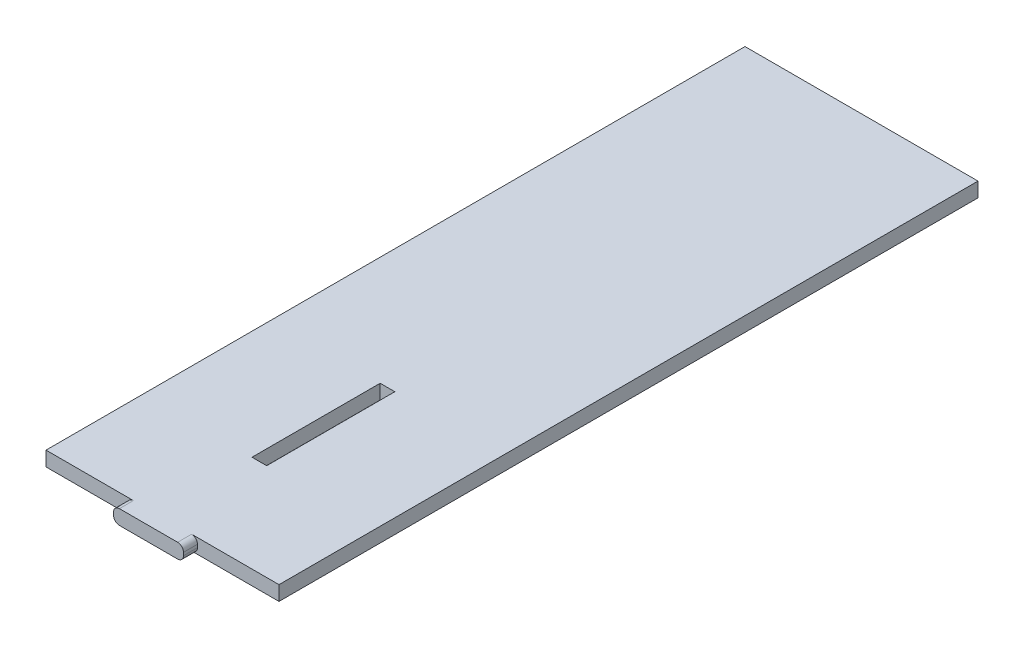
ISO-10303-21;
HEADER;
FILE_DESCRIPTION(('STEP AP214'),'2;1');
FILE_NAME('part.step','',(''),(''),'','','');
FILE_SCHEMA(('AUTOMOTIVE_DESIGN { 1 0 10303 214 1 1 1 1 }'));
ENDSEC;
DATA;
#1=APPLICATION_CONTEXT('core data for automotive mechanical design processes');
#2=APPLICATION_PROTOCOL_DEFINITION('international standard','automotive_design',2000,#1);
#3=PRODUCT_CONTEXT('',#1,'mechanical');
#4=PRODUCT('Part','Part','',(#3));
#5=PRODUCT_RELATED_PRODUCT_CATEGORY('part','',(#4));
#6=PRODUCT_DEFINITION_FORMATION('','',#4);
#7=PRODUCT_DEFINITION_CONTEXT('part definition',#1,'design');
#8=PRODUCT_DEFINITION('design','',#6,#7);
#9=PRODUCT_DEFINITION_SHAPE('','',#8);
#10=(LENGTH_UNIT() NAMED_UNIT(*) SI_UNIT(.MILLI.,.METRE.));
#11=(NAMED_UNIT(*) PLANE_ANGLE_UNIT() SI_UNIT($,.RADIAN.));
#12=(NAMED_UNIT(*) SI_UNIT($,.STERADIAN.) SOLID_ANGLE_UNIT());
#13=UNCERTAINTY_MEASURE_WITH_UNIT(LENGTH_MEASURE(1.E-05),#10,'distance_accuracy_value','');
#14=(GEOMETRIC_REPRESENTATION_CONTEXT(3) GLOBAL_UNCERTAINTY_ASSIGNED_CONTEXT((#13)) GLOBAL_UNIT_ASSIGNED_CONTEXT((#10,
#11,#12)) REPRESENTATION_CONTEXT('',''));
#15=CARTESIAN_POINT('',(0.,0.,0.));
#16=DIRECTION('',(0.,0.,1.));
#17=DIRECTION('',(1.,0.,0.));
#18=AXIS2_PLACEMENT_3D('',#15,#16,#17);
#19=CARTESIAN_POINT('',(-118.557767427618,12.5,350.));
#20=DIRECTION('',(0.,0.,-1.));
#21=DIRECTION('',(-1.,0.,0.));
#22=AXIS2_PLACEMENT_3D('',#19,#20,#21);
#23=PLANE('',#22);
#24=CARTESIAN_POINT('',(-43.5577674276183,4.99999999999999,350.));
#25=DIRECTION('',(0.,0.,1.));
#26=DIRECTION('',(1.,0.,0.));
#27=AXIS2_PLACEMENT_3D('',#24,#25,#26);
#28=CIRCLE('',#27,4.99999999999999);
#29=CARTESIAN_POINT('',(-48.5577674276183,4.99999999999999,350.));
#30=VERTEX_POINT('',#29);
#31=CARTESIAN_POINT('',(-43.5577674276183,0.,350.));
#32=VERTEX_POINT('',#31);
#33=EDGE_CURVE('E187',#30,#32,#28,.T.);
#34=ORIENTED_EDGE('',*,*,#33,.F.);
#35=DIRECTION('',(0.,-1.,0.));
#36=VECTOR('',#35,1.);
#37=CARTESIAN_POINT('',(-48.5577674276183,7.5,350.));
#38=LINE('',#37,#36);
#39=CARTESIAN_POINT('',(-48.5577674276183,7.5,350.));
#40=VERTEX_POINT('',#39);
#41=EDGE_CURVE('E213',#40,#30,#38,.T.);
#42=ORIENTED_EDGE('',*,*,#41,.F.);
#43=CARTESIAN_POINT('',(-43.5577674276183,7.5,350.));
#44=DIRECTION('',(0.,0.,1.));
#45=DIRECTION('',(1.,0.,0.));
#46=AXIS2_PLACEMENT_3D('',#43,#44,#45);
#47=CIRCLE('',#46,5.);
#48=CARTESIAN_POINT('',(-43.5577674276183,12.5,350.));
#49=VERTEX_POINT('',#48);
#50=EDGE_CURVE('E210',#49,#40,#47,.T.);
#51=ORIENTED_EDGE('',*,*,#50,.F.);
#52=DIRECTION('',(1.,0.,0.));
#53=VECTOR('',#52,1.);
#54=CARTESIAN_POINT('',(-118.557767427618,12.5,350.));
#55=LINE('',#54,#53);
#56=CARTESIAN_POINT('',(-118.557767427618,12.5,350.));
#57=VERTEX_POINT('',#56);
#58=EDGE_CURVE('E247',#57,#49,#55,.T.);
#59=ORIENTED_EDGE('',*,*,#58,.F.);
#60=DIRECTION('',(0.,-1.,0.));
#61=VECTOR('',#60,1.);
#62=CARTESIAN_POINT('',(-118.557767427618,12.5,350.));
#63=LINE('',#62,#61);
#64=CARTESIAN_POINT('',(-118.557767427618,0.,350.));
#65=VERTEX_POINT('',#64);
#66=EDGE_CURVE('E11',#57,#65,#63,.T.);
#67=ORIENTED_EDGE('',*,*,#66,.T.);
#68=DIRECTION('',(1.,0.,0.));
#69=VECTOR('',#68,1.);
#70=CARTESIAN_POINT('',(-118.557767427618,0.,350.));
#71=LINE('',#70,#69);
#72=EDGE_CURVE('E258',#65,#32,#71,.T.);
#73=ORIENTED_EDGE('',*,*,#72,.T.);
#74=EDGE_LOOP('',(#34,#42,#51,#59,#67,#73));
#75=FACE_BOUND('',#74,.T.);
#76=ADVANCED_FACE('F33',(#75),#23,.F.);
#77=CARTESIAN_POINT('',(6.44223257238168,5.,350.));
#78=DIRECTION('',(0.,0.,1.));
#79=DIRECTION('',(1.,0.,0.));
#80=AXIS2_PLACEMENT_3D('',#77,#78,#79);
#81=CIRCLE('',#80,4.99999999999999);
#82=CARTESIAN_POINT('',(6.44223257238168,0.,350.));
#83=VERTEX_POINT('',#82);
#84=CARTESIAN_POINT('',(11.4422325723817,5.,350.));
#85=VERTEX_POINT('',#84);
#86=EDGE_CURVE('E179',#83,#85,#81,.T.);
#87=ORIENTED_EDGE('',*,*,#86,.F.);
#88=CARTESIAN_POINT('',(81.4422325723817,0.,350.));
#89=VERTEX_POINT('',#88);
#90=EDGE_CURVE('E257',#83,#89,#71,.T.);
#91=ORIENTED_EDGE('',*,*,#90,.T.);
#92=DIRECTION('',(0.,-1.,0.));
#93=VECTOR('',#92,1.);
#94=CARTESIAN_POINT('',(81.4422325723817,12.5,350.));
#95=LINE('',#94,#93);
#96=CARTESIAN_POINT('',(81.4422325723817,12.5,350.));
#97=VERTEX_POINT('',#96);
#98=EDGE_CURVE('E41',#97,#89,#95,.T.);
#99=ORIENTED_EDGE('',*,*,#98,.F.);
#100=CARTESIAN_POINT('',(6.44223257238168,12.5,350.));
#101=VERTEX_POINT('',#100);
#102=EDGE_CURVE('E245',#101,#97,#55,.T.);
#103=ORIENTED_EDGE('',*,*,#102,.F.);
#104=CARTESIAN_POINT('',(6.44223257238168,7.50000000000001,350.));
#105=DIRECTION('',(0.,0.,1.));
#106=DIRECTION('',(-1.,0.,0.));
#107=AXIS2_PLACEMENT_3D('',#104,#105,#106);
#108=CIRCLE('',#107,5.);
#109=CARTESIAN_POINT('',(11.4422325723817,7.50000000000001,350.));
#110=VERTEX_POINT('',#109);
#111=EDGE_CURVE('E207',#110,#101,#108,.T.);
#112=ORIENTED_EDGE('',*,*,#111,.F.);
#113=DIRECTION('',(0.,1.,0.));
#114=VECTOR('',#113,1.);
#115=CARTESIAN_POINT('',(11.4422325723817,7.50000000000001,350.));
#116=LINE('',#115,#114);
#117=EDGE_CURVE('E204',#85,#110,#116,.T.);
#118=ORIENTED_EDGE('',*,*,#117,.F.);
#119=EDGE_LOOP('',(#87,#91,#99,#103,#112,#118));
#120=FACE_BOUND('',#119,.T.);
#121=ADVANCED_FACE('F291',(#120),#23,.F.);
#122=CARTESIAN_POINT('',(-118.557767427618,12.5,350.));
#123=DIRECTION('',(1.,0.,0.));
#124=DIRECTION('',(0.,0.,-1.));
#125=AXIS2_PLACEMENT_3D('',#122,#123,#124);
#126=PLANE('',#125);
#127=DIRECTION('',(0.,0.,1.));
#128=VECTOR('',#127,1.);
#129=CARTESIAN_POINT('',(-118.557767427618,0.,350.));
#130=LINE('',#129,#128);
#131=CARTESIAN_POINT('',(-118.557767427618,0.,-250.));
#132=VERTEX_POINT('',#131);
#133=EDGE_CURVE('E241',#132,#65,#130,.T.);
#134=ORIENTED_EDGE('',*,*,#133,.T.);
#135=ORIENTED_EDGE('',*,*,#66,.F.);
#136=DIRECTION('',(0.,0.,1.));
#137=VECTOR('',#136,1.);
#138=CARTESIAN_POINT('',(-118.557767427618,12.5,350.));
#139=LINE('',#138,#137);
#140=CARTESIAN_POINT('',(-118.557767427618,12.5,-250.));
#141=VERTEX_POINT('',#140);
#142=EDGE_CURVE('E242',#141,#57,#139,.T.);
#143=ORIENTED_EDGE('',*,*,#142,.F.);
#144=DIRECTION('',(0.,-1.,0.));
#145=VECTOR('',#144,1.);
#146=CARTESIAN_POINT('',(-118.557767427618,12.5,-250.));
#147=LINE('',#146,#145);
#148=EDGE_CURVE('E254',#141,#132,#147,.T.);
#149=ORIENTED_EDGE('',*,*,#148,.T.);
#150=EDGE_LOOP('',(#134,#135,#143,#149));
#151=FACE_BOUND('',#150,.T.);
#152=ADVANCED_FACE('F35',(#151),#126,.F.);
#153=CARTESIAN_POINT('',(81.4422325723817,12.5,350.));
#154=DIRECTION('',(-1.,0.,0.));
#155=DIRECTION('',(0.,0.,1.));
#156=AXIS2_PLACEMENT_3D('',#153,#154,#155);
#157=PLANE('',#156);
#158=DIRECTION('',(0.,0.,-1.));
#159=VECTOR('',#158,1.);
#160=CARTESIAN_POINT('',(81.4422325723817,0.,350.));
#161=LINE('',#160,#159);
#162=CARTESIAN_POINT('',(81.4422325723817,0.,-250.));
#163=VERTEX_POINT('',#162);
#164=EDGE_CURVE('E260',#89,#163,#161,.T.);
#165=ORIENTED_EDGE('',*,*,#164,.T.);
#166=DIRECTION('',(0.,-1.,0.));
#167=VECTOR('',#166,1.);
#168=CARTESIAN_POINT('',(81.4422325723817,12.5,-250.));
#169=LINE('',#168,#167);
#170=CARTESIAN_POINT('',(81.4422325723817,12.5,-250.));
#171=VERTEX_POINT('',#170);
#172=EDGE_CURVE('E265',#171,#163,#169,.T.);
#173=ORIENTED_EDGE('',*,*,#172,.F.);
#174=DIRECTION('',(0.,0.,-1.));
#175=VECTOR('',#174,1.);
#176=CARTESIAN_POINT('',(81.4422325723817,12.5,350.));
#177=LINE('',#176,#175);
#178=EDGE_CURVE('E250',#97,#171,#177,.T.);
#179=ORIENTED_EDGE('',*,*,#178,.F.);
#180=ORIENTED_EDGE('',*,*,#98,.T.);
#181=EDGE_LOOP('',(#165,#173,#179,#180));
#182=FACE_BOUND('',#181,.T.);
#183=ADVANCED_FACE('F272',(#182),#157,.F.);
#184=CARTESIAN_POINT('',(-118.557767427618,12.5,-250.));
#185=DIRECTION('',(0.,0.,1.));
#186=DIRECTION('',(1.,0.,0.));
#187=AXIS2_PLACEMENT_3D('',#184,#185,#186);
#188=PLANE('',#187);
#189=DIRECTION('',(-1.,0.,0.));
#190=VECTOR('',#189,1.);
#191=CARTESIAN_POINT('',(-118.557767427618,0.,-250.));
#192=LINE('',#191,#190);
#193=EDGE_CURVE('E246',#163,#132,#192,.T.);
#194=ORIENTED_EDGE('',*,*,#193,.T.);
#195=ORIENTED_EDGE('',*,*,#148,.F.);
#196=DIRECTION('',(-1.,0.,0.));
#197=VECTOR('',#196,1.);
#198=CARTESIAN_POINT('',(-118.557767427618,12.5,-250.));
#199=LINE('',#198,#197);
#200=EDGE_CURVE('E252',#171,#141,#199,.T.);
#201=ORIENTED_EDGE('',*,*,#200,.F.);
#202=ORIENTED_EDGE('',*,*,#172,.T.);
#203=EDGE_LOOP('',(#194,#195,#201,#202));
#204=FACE_BOUND('',#203,.T.);
#205=ADVANCED_FACE('F283',(#204),#188,.F.);
#206=CARTESIAN_POINT('',(0.,12.5,0.));
#207=DIRECTION('',(0.,-1.,0.));
#208=DIRECTION('',(0.,0.,-1.));
#209=AXIS2_PLACEMENT_3D('',#206,#207,#208);
#210=PLANE('',#209);
#211=DIRECTION('',(0.,0.,1.));
#212=VECTOR('',#211,1.);
#213=CARTESIAN_POINT('',(-12.2577674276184,12.5,266.879992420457));
#214=LINE('',#213,#212);
#215=CARTESIAN_POINT('',(-12.2577674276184,12.5,156.879992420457));
#216=VERTEX_POINT('',#215);
#217=CARTESIAN_POINT('',(-12.2577674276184,12.5,266.879992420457));
#218=VERTEX_POINT('',#217);
#219=EDGE_CURVE('E154',#216,#218,#214,.T.);
#220=ORIENTED_EDGE('',*,*,#219,.T.);
#221=DIRECTION('',(-1.,0.,0.));
#222=VECTOR('',#221,1.);
#223=CARTESIAN_POINT('',(-12.2577674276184,12.5,266.879992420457));
#224=LINE('',#223,#222);
#225=CARTESIAN_POINT('',(-24.8577674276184,12.5,266.879992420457));
#226=VERTEX_POINT('',#225);
#227=EDGE_CURVE('E148',#218,#226,#224,.T.);
#228=ORIENTED_EDGE('',*,*,#227,.T.);
#229=DIRECTION('',(0.,0.,-1.));
#230=VECTOR('',#229,1.);
#231=CARTESIAN_POINT('',(-24.8577674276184,12.5,266.879992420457));
#232=LINE('',#231,#230);
#233=CARTESIAN_POINT('',(-24.8577674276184,12.5,156.879992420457));
#234=VERTEX_POINT('',#233);
#235=EDGE_CURVE('E157',#226,#234,#232,.T.);
#236=ORIENTED_EDGE('',*,*,#235,.T.);
#237=DIRECTION('',(1.,0.,0.));
#238=VECTOR('',#237,1.);
#239=CARTESIAN_POINT('',(-12.2577674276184,12.5,156.879992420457));
#240=LINE('',#239,#238);
#241=EDGE_CURVE('E48',#234,#216,#240,.T.);
#242=ORIENTED_EDGE('',*,*,#241,.T.);
#243=EDGE_LOOP('',(#220,#228,#236,#242));
#244=FACE_BOUND('',#243,.T.);
#245=ORIENTED_EDGE('',*,*,#142,.T.);
#246=ORIENTED_EDGE('',*,*,#58,.T.);
#247=DIRECTION('',(0.,0.,-1.));
#248=VECTOR('',#247,1.);
#249=CARTESIAN_POINT('',(-43.5577674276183,12.5,362.));
#250=LINE('',#249,#248);
#251=CARTESIAN_POINT('',(-43.5577674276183,12.5,362.));
#252=VERTEX_POINT('',#251);
#253=EDGE_CURVE('E229',#252,#49,#250,.T.);
#254=ORIENTED_EDGE('',*,*,#253,.F.);
#255=DIRECTION('',(-1.,0.,0.));
#256=VECTOR('',#255,1.);
#257=CARTESIAN_POINT('',(-43.5577674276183,12.5,362.));
#258=LINE('',#257,#256);
#259=CARTESIAN_POINT('',(6.44223257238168,12.5,362.));
#260=VERTEX_POINT('',#259);
#261=EDGE_CURVE('E191',#260,#252,#258,.T.);
#262=ORIENTED_EDGE('',*,*,#261,.F.);
#263=DIRECTION('',(0.,0.,-1.));
#264=VECTOR('',#263,1.);
#265=CARTESIAN_POINT('',(6.44223257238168,12.5,362.));
#266=LINE('',#265,#264);
#267=EDGE_CURVE('E232',#260,#101,#266,.T.);
#268=ORIENTED_EDGE('',*,*,#267,.T.);
#269=ORIENTED_EDGE('',*,*,#102,.T.);
#270=ORIENTED_EDGE('',*,*,#178,.T.);
#271=ORIENTED_EDGE('',*,*,#200,.T.);
#272=EDGE_LOOP('',(#245,#246,#254,#262,#268,#269,#270,#271));
#273=FACE_BOUND('',#272,.T.);
#274=ADVANCED_FACE('F161',(#244,#273),#210,.F.);
#275=CARTESIAN_POINT('',(0.,0.,0.));
#276=DIRECTION('',(0.,-1.,0.));
#277=DIRECTION('',(0.,0.,-1.));
#278=AXIS2_PLACEMENT_3D('',#275,#276,#277);
#279=PLANE('',#278);
#280=DIRECTION('',(-1.,0.,0.));
#281=VECTOR('',#280,1.);
#282=CARTESIAN_POINT('',(-12.2577674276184,0.,266.879992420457));
#283=LINE('',#282,#281);
#284=CARTESIAN_POINT('',(-12.2577674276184,0.,266.879992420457));
#285=VERTEX_POINT('',#284);
#286=CARTESIAN_POINT('',(-24.8577674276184,0.,266.879992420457));
#287=VERTEX_POINT('',#286);
#288=EDGE_CURVE('E56',#285,#287,#283,.T.);
#289=ORIENTED_EDGE('',*,*,#288,.F.);
#290=DIRECTION('',(0.,0.,1.));
#291=VECTOR('',#290,1.);
#292=CARTESIAN_POINT('',(-12.2577674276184,0.,266.879992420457));
#293=LINE('',#292,#291);
#294=CARTESIAN_POINT('',(-12.2577674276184,0.,156.879992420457));
#295=VERTEX_POINT('',#294);
#296=EDGE_CURVE('E164',#295,#285,#293,.T.);
#297=ORIENTED_EDGE('',*,*,#296,.F.);
#298=DIRECTION('',(1.,0.,0.));
#299=VECTOR('',#298,1.);
#300=CARTESIAN_POINT('',(-12.2577674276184,0.,156.879992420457));
#301=LINE('',#300,#299);
#302=CARTESIAN_POINT('',(-24.8577674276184,0.,156.879992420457));
#303=VERTEX_POINT('',#302);
#304=EDGE_CURVE('E167',#303,#295,#301,.T.);
#305=ORIENTED_EDGE('',*,*,#304,.F.);
#306=DIRECTION('',(0.,0.,-1.));
#307=VECTOR('',#306,1.);
#308=CARTESIAN_POINT('',(-24.8577674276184,0.,266.879992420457));
#309=LINE('',#308,#307);
#310=EDGE_CURVE('E173',#287,#303,#309,.T.);
#311=ORIENTED_EDGE('',*,*,#310,.F.);
#312=EDGE_LOOP('',(#289,#297,#305,#311));
#313=FACE_BOUND('',#312,.T.);
#314=ORIENTED_EDGE('',*,*,#133,.F.);
#315=ORIENTED_EDGE('',*,*,#193,.F.);
#316=ORIENTED_EDGE('',*,*,#164,.F.);
#317=ORIENTED_EDGE('',*,*,#90,.F.);
#318=DIRECTION('',(0.,0.,-1.));
#319=VECTOR('',#318,1.);
#320=CARTESIAN_POINT('',(6.44223257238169,0.,362.));
#321=LINE('',#320,#319);
#322=CARTESIAN_POINT('',(6.44223257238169,0.,362.));
#323=VERTEX_POINT('',#322);
#324=EDGE_CURVE('E201',#323,#83,#321,.T.);
#325=ORIENTED_EDGE('',*,*,#324,.F.);
#326=DIRECTION('',(1.,0.,0.));
#327=VECTOR('',#326,1.);
#328=CARTESIAN_POINT('',(-43.5577674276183,0.,362.));
#329=LINE('',#328,#327);
#330=CARTESIAN_POINT('',(-43.5577674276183,0.,362.));
#331=VERTEX_POINT('',#330);
#332=EDGE_CURVE('E199',#331,#323,#329,.T.);
#333=ORIENTED_EDGE('',*,*,#332,.F.);
#334=DIRECTION('',(0.,0.,-1.));
#335=VECTOR('',#334,1.);
#336=CARTESIAN_POINT('',(-43.5577674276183,0.,362.));
#337=LINE('',#336,#335);
#338=EDGE_CURVE('E220',#331,#32,#337,.T.);
#339=ORIENTED_EDGE('',*,*,#338,.T.);
#340=ORIENTED_EDGE('',*,*,#72,.F.);
#341=EDGE_LOOP('',(#314,#315,#316,#317,#325,#333,#339,#340));
#342=FACE_BOUND('',#341,.T.);
#343=ADVANCED_FACE('F279',(#313,#342),#279,.T.);
#344=CARTESIAN_POINT('',(6.44223257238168,5.,362.));
#345=DIRECTION('',(0.,0.,-1.));
#346=DIRECTION('',(-1.,0.,0.));
#347=AXIS2_PLACEMENT_3D('',#344,#345,#346);
#348=CYLINDRICAL_SURFACE('',#347,4.99999999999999);
#349=ORIENTED_EDGE('',*,*,#86,.T.);
#350=DIRECTION('',(0.,0.,-1.));
#351=VECTOR('',#350,1.);
#352=CARTESIAN_POINT('',(11.4422325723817,5.,362.));
#353=LINE('',#352,#351);
#354=CARTESIAN_POINT('',(11.4422325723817,5.,362.));
#355=VERTEX_POINT('',#354);
#356=EDGE_CURVE('E238',#355,#85,#353,.T.);
#357=ORIENTED_EDGE('',*,*,#356,.F.);
#358=CARTESIAN_POINT('',(6.44223257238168,5.,362.));
#359=DIRECTION('',(0.,0.,1.));
#360=DIRECTION('',(1.,0.,0.));
#361=AXIS2_PLACEMENT_3D('',#358,#359,#360);
#362=CIRCLE('',#361,4.99999999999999);
#363=EDGE_CURVE('E183',#323,#355,#362,.T.);
#364=ORIENTED_EDGE('',*,*,#363,.F.);
#365=ORIENTED_EDGE('',*,*,#324,.T.);
#366=EDGE_LOOP('',(#349,#357,#364,#365));
#367=FACE_BOUND('',#366,.T.);
#368=ADVANCED_FACE('F300',(#367),#348,.T.);
#369=CARTESIAN_POINT('',(11.4422325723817,7.50000000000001,362.));
#370=DIRECTION('',(-1.,0.,0.));
#371=DIRECTION('',(0.,0.,1.));
#372=AXIS2_PLACEMENT_3D('',#369,#370,#371);
#373=PLANE('',#372);
#374=ORIENTED_EDGE('',*,*,#117,.T.);
#375=DIRECTION('',(0.,0.,-1.));
#376=VECTOR('',#375,1.);
#377=CARTESIAN_POINT('',(11.4422325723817,7.50000000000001,362.));
#378=LINE('',#377,#376);
#379=CARTESIAN_POINT('',(11.4422325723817,7.50000000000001,362.));
#380=VERTEX_POINT('',#379);
#381=EDGE_CURVE('E235',#380,#110,#378,.T.);
#382=ORIENTED_EDGE('',*,*,#381,.F.);
#383=DIRECTION('',(0.,1.,0.));
#384=VECTOR('',#383,1.);
#385=CARTESIAN_POINT('',(11.4422325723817,7.50000000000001,362.));
#386=LINE('',#385,#384);
#387=EDGE_CURVE('E186',#355,#380,#386,.T.);
#388=ORIENTED_EDGE('',*,*,#387,.F.);
#389=ORIENTED_EDGE('',*,*,#356,.T.);
#390=EDGE_LOOP('',(#374,#382,#388,#389));
#391=FACE_BOUND('',#390,.T.);
#392=ADVANCED_FACE('F297',(#391),#373,.F.);
#393=CARTESIAN_POINT('',(6.44223257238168,7.50000000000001,362.));
#394=DIRECTION('',(0.,0.,-1.));
#395=DIRECTION('',(-1.,0.,0.));
#396=AXIS2_PLACEMENT_3D('',#393,#394,#395);
#397=CYLINDRICAL_SURFACE('',#396,5.);
#398=ORIENTED_EDGE('',*,*,#111,.T.);
#399=ORIENTED_EDGE('',*,*,#267,.F.);
#400=CARTESIAN_POINT('',(6.44223257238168,7.50000000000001,362.));
#401=DIRECTION('',(0.,0.,1.));
#402=DIRECTION('',(-1.,0.,0.));
#403=AXIS2_PLACEMENT_3D('',#400,#401,#402);
#404=CIRCLE('',#403,5.);
#405=EDGE_CURVE('E189',#380,#260,#404,.T.);
#406=ORIENTED_EDGE('',*,*,#405,.F.);
#407=ORIENTED_EDGE('',*,*,#381,.T.);
#408=EDGE_LOOP('',(#398,#399,#406,#407));
#409=FACE_BOUND('',#408,.T.);
#410=ADVANCED_FACE('F293',(#409),#397,.T.);
#411=CARTESIAN_POINT('',(-43.5577674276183,7.5,362.));
#412=DIRECTION('',(0.,0.,-1.));
#413=DIRECTION('',(-1.,0.,0.));
#414=AXIS2_PLACEMENT_3D('',#411,#412,#413);
#415=CYLINDRICAL_SURFACE('',#414,5.);
#416=ORIENTED_EDGE('',*,*,#50,.T.);
#417=DIRECTION('',(0.,0.,-1.));
#418=VECTOR('',#417,1.);
#419=CARTESIAN_POINT('',(-48.5577674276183,7.5,362.));
#420=LINE('',#419,#418);
#421=CARTESIAN_POINT('',(-48.5577674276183,7.5,362.));
#422=VERTEX_POINT('',#421);
#423=EDGE_CURVE('E226',#422,#40,#420,.T.);
#424=ORIENTED_EDGE('',*,*,#423,.F.);
#425=CARTESIAN_POINT('',(-43.5577674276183,7.5,362.));
#426=DIRECTION('',(0.,0.,1.));
#427=DIRECTION('',(1.,0.,0.));
#428=AXIS2_PLACEMENT_3D('',#425,#426,#427);
#429=CIRCLE('',#428,5.);
#430=EDGE_CURVE('E193',#252,#422,#429,.T.);
#431=ORIENTED_EDGE('',*,*,#430,.F.);
#432=ORIENTED_EDGE('',*,*,#253,.T.);
#433=EDGE_LOOP('',(#416,#424,#431,#432));
#434=FACE_BOUND('',#433,.T.);
#435=ADVANCED_FACE('F317',(#434),#415,.T.);
#436=CARTESIAN_POINT('',(-48.5577674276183,7.5,362.));
#437=DIRECTION('',(1.,0.,0.));
#438=DIRECTION('',(0.,0.,-1.));
#439=AXIS2_PLACEMENT_3D('',#436,#437,#438);
#440=PLANE('',#439);
#441=ORIENTED_EDGE('',*,*,#41,.T.);
#442=DIRECTION('',(0.,0.,-1.));
#443=VECTOR('',#442,1.);
#444=CARTESIAN_POINT('',(-48.5577674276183,4.99999999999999,362.));
#445=LINE('',#444,#443);
#446=CARTESIAN_POINT('',(-48.5577674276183,4.99999999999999,362.));
#447=VERTEX_POINT('',#446);
#448=EDGE_CURVE('E223',#447,#30,#445,.T.);
#449=ORIENTED_EDGE('',*,*,#448,.F.);
#450=DIRECTION('',(0.,-1.,0.));
#451=VECTOR('',#450,1.);
#452=CARTESIAN_POINT('',(-48.5577674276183,7.5,362.));
#453=LINE('',#452,#451);
#454=EDGE_CURVE('E195',#422,#447,#453,.T.);
#455=ORIENTED_EDGE('',*,*,#454,.F.);
#456=ORIENTED_EDGE('',*,*,#423,.T.);
#457=EDGE_LOOP('',(#441,#449,#455,#456));
#458=FACE_BOUND('',#457,.T.);
#459=ADVANCED_FACE('F313',(#458),#440,.F.);
#460=CARTESIAN_POINT('',(-43.5577674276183,4.99999999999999,362.));
#461=DIRECTION('',(0.,0.,-1.));
#462=DIRECTION('',(-1.,0.,0.));
#463=AXIS2_PLACEMENT_3D('',#460,#461,#462);
#464=CYLINDRICAL_SURFACE('',#463,4.99999999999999);
#465=ORIENTED_EDGE('',*,*,#33,.T.);
#466=ORIENTED_EDGE('',*,*,#338,.F.);
#467=CARTESIAN_POINT('',(-43.5577674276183,4.99999999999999,362.));
#468=DIRECTION('',(0.,0.,1.));
#469=DIRECTION('',(1.,0.,0.));
#470=AXIS2_PLACEMENT_3D('',#467,#468,#469);
#471=CIRCLE('',#470,4.99999999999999);
#472=EDGE_CURVE('E197',#447,#331,#471,.T.);
#473=ORIENTED_EDGE('',*,*,#472,.F.);
#474=ORIENTED_EDGE('',*,*,#448,.T.);
#475=EDGE_LOOP('',(#465,#466,#473,#474));
#476=FACE_BOUND('',#475,.T.);
#477=ADVANCED_FACE('F310',(#476),#464,.T.);
#478=CARTESIAN_POINT('',(6.44223257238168,5.,362.));
#479=DIRECTION('',(0.,0.,1.));
#480=DIRECTION('',(1.,0.,0.));
#481=AXIS2_PLACEMENT_3D('',#478,#479,#480);
#482=PLANE('',#481);
#483=ORIENTED_EDGE('',*,*,#363,.T.);
#484=ORIENTED_EDGE('',*,*,#387,.T.);
#485=ORIENTED_EDGE('',*,*,#405,.T.);
#486=ORIENTED_EDGE('',*,*,#261,.T.);
#487=ORIENTED_EDGE('',*,*,#430,.T.);
#488=ORIENTED_EDGE('',*,*,#454,.T.);
#489=ORIENTED_EDGE('',*,*,#472,.T.);
#490=ORIENTED_EDGE('',*,*,#332,.T.);
#491=EDGE_LOOP('',(#483,#484,#485,#486,#487,#488,#489,#490));
#492=FACE_BOUND('',#491,.T.);
#493=ADVANCED_FACE('F305',(#492),#482,.T.);
#494=CARTESIAN_POINT('',(-12.2577674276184,12.5,266.879992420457));
#495=DIRECTION('',(0.,0.,1.));
#496=DIRECTION('',(1.,0.,0.));
#497=AXIS2_PLACEMENT_3D('',#494,#495,#496);
#498=PLANE('',#497);
#499=ORIENTED_EDGE('',*,*,#288,.T.);
#500=DIRECTION('',(0.,-1.,0.));
#501=VECTOR('',#500,1.);
#502=CARTESIAN_POINT('',(-24.8577674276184,12.5,266.879992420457));
#503=LINE('',#502,#501);
#504=EDGE_CURVE('E144',#226,#287,#503,.T.);
#505=ORIENTED_EDGE('',*,*,#504,.F.);
#506=ORIENTED_EDGE('',*,*,#227,.F.);
#507=DIRECTION('',(0.,-1.,0.));
#508=VECTOR('',#507,1.);
#509=CARTESIAN_POINT('',(-12.2577674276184,12.5,266.879992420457));
#510=LINE('',#509,#508);
#511=EDGE_CURVE('E177',#218,#285,#510,.T.);
#512=ORIENTED_EDGE('',*,*,#511,.T.);
#513=EDGE_LOOP('',(#499,#505,#506,#512));
#514=FACE_BOUND('',#513,.T.);
#515=ADVANCED_FACE('F146',(#514),#498,.F.);
#516=CARTESIAN_POINT('',(-12.2577674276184,12.5,266.879992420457));
#517=DIRECTION('',(1.,0.,0.));
#518=DIRECTION('',(0.,0.,-1.));
#519=AXIS2_PLACEMENT_3D('',#516,#517,#518);
#520=PLANE('',#519);
#521=ORIENTED_EDGE('',*,*,#296,.T.);
#522=ORIENTED_EDGE('',*,*,#511,.F.);
#523=ORIENTED_EDGE('',*,*,#219,.F.);
#524=DIRECTION('',(0.,-1.,0.));
#525=VECTOR('',#524,1.);
#526=CARTESIAN_POINT('',(-12.2577674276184,12.5,156.879992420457));
#527=LINE('',#526,#525);
#528=EDGE_CURVE('E180',#216,#295,#527,.T.);
#529=ORIENTED_EDGE('',*,*,#528,.T.);
#530=EDGE_LOOP('',(#521,#522,#523,#529));
#531=FACE_BOUND('',#530,.T.);
#532=ADVANCED_FACE('F402',(#531),#520,.F.);
#533=CARTESIAN_POINT('',(-12.2577674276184,12.5,156.879992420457));
#534=DIRECTION('',(0.,0.,-1.));
#535=DIRECTION('',(-1.,0.,0.));
#536=AXIS2_PLACEMENT_3D('',#533,#534,#535);
#537=PLANE('',#536);
#538=ORIENTED_EDGE('',*,*,#304,.T.);
#539=ORIENTED_EDGE('',*,*,#528,.F.);
#540=ORIENTED_EDGE('',*,*,#241,.F.);
#541=DIRECTION('',(0.,-1.,0.));
#542=VECTOR('',#541,1.);
#543=CARTESIAN_POINT('',(-24.8577674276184,12.5,156.879992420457));
#544=LINE('',#543,#542);
#545=EDGE_CURVE('E153',#234,#303,#544,.T.);
#546=ORIENTED_EDGE('',*,*,#545,.T.);
#547=EDGE_LOOP('',(#538,#539,#540,#546));
#548=FACE_BOUND('',#547,.T.);
#549=ADVANCED_FACE('F411',(#548),#537,.F.);
#550=CARTESIAN_POINT('',(-24.8577674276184,12.5,266.879992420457));
#551=DIRECTION('',(-1.,0.,0.));
#552=DIRECTION('',(0.,0.,1.));
#553=AXIS2_PLACEMENT_3D('',#550,#551,#552);
#554=PLANE('',#553);
#555=ORIENTED_EDGE('',*,*,#310,.T.);
#556=ORIENTED_EDGE('',*,*,#545,.F.);
#557=ORIENTED_EDGE('',*,*,#235,.F.);
#558=ORIENTED_EDGE('',*,*,#504,.T.);
#559=EDGE_LOOP('',(#555,#556,#557,#558));
#560=FACE_BOUND('',#559,.T.);
#561=ADVANCED_FACE('F158',(#560),#554,.F.);
#562=CLOSED_SHELL('',(#76,#121,#152,#183,#205,#274,#343,#368,#392,#410,#435,#459,#477,#493,#515,
#532,#549,#561));
#563=MANIFOLD_SOLID_BREP('B2',#562);
#564=ADVANCED_BREP_SHAPE_REPRESENTATION('',(#18,#563),#14);
#565=SHAPE_DEFINITION_REPRESENTATION(#9,#564);
ENDSEC;
END-ISO-10303-21;
